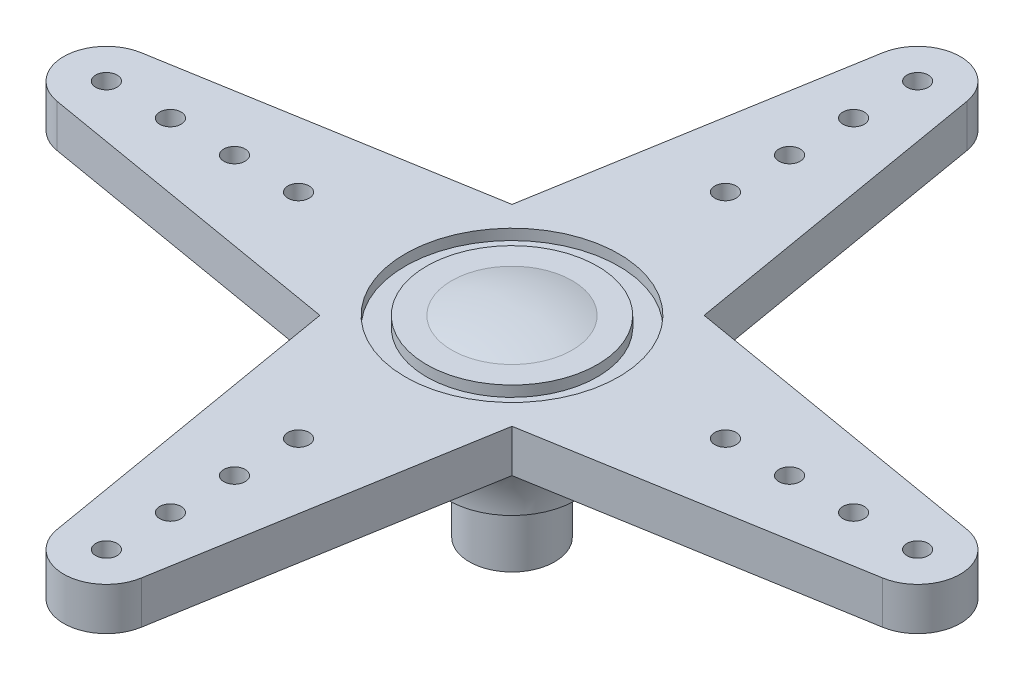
ISO-10303-21;
HEADER;
FILE_DESCRIPTION(('STEP AP214'),'2;1');
FILE_NAME('part.step','',(''),(''),'','','');
FILE_SCHEMA(('AUTOMOTIVE_DESIGN { 1 0 10303 214 1 1 1 1 }'));
ENDSEC;
DATA;
#1=APPLICATION_CONTEXT('core data for automotive mechanical design processes');
#2=APPLICATION_PROTOCOL_DEFINITION('international standard','automotive_design',2000,#1);
#3=PRODUCT_CONTEXT('',#1,'mechanical');
#4=PRODUCT('Part','Part','',(#3));
#5=PRODUCT_RELATED_PRODUCT_CATEGORY('part','',(#4));
#6=PRODUCT_DEFINITION_FORMATION('','',#4);
#7=PRODUCT_DEFINITION_CONTEXT('part definition',#1,'design');
#8=PRODUCT_DEFINITION('design','',#6,#7);
#9=PRODUCT_DEFINITION_SHAPE('','',#8);
#10=(LENGTH_UNIT() NAMED_UNIT(*) SI_UNIT(.MILLI.,.METRE.));
#11=(NAMED_UNIT(*) PLANE_ANGLE_UNIT() SI_UNIT($,.RADIAN.));
#12=(NAMED_UNIT(*) SI_UNIT($,.STERADIAN.) SOLID_ANGLE_UNIT());
#13=UNCERTAINTY_MEASURE_WITH_UNIT(LENGTH_MEASURE(1.E-05),#10,'distance_accuracy_value','');
#14=(GEOMETRIC_REPRESENTATION_CONTEXT(3) GLOBAL_UNCERTAINTY_ASSIGNED_CONTEXT((#13)) GLOBAL_UNIT_ASSIGNED_CONTEXT((#10,
#11,#12)) REPRESENTATION_CONTEXT('',''));
#15=CARTESIAN_POINT('',(0.,0.,0.));
#16=DIRECTION('',(0.,0.,1.));
#17=DIRECTION('',(1.,0.,0.));
#18=AXIS2_PLACEMENT_3D('',#15,#16,#17);
#19=CARTESIAN_POINT('',(19.,9.,0.));
#20=DIRECTION('',(0.,-1.,0.));
#21=DIRECTION('',(0.,0.,-1.));
#22=AXIS2_PLACEMENT_3D('',#19,#20,#21);
#23=PLANE('',#22);
#24=CARTESIAN_POINT('',(0.,9.,0.));
#25=DIRECTION('',(0.,1.,0.));
#26=DIRECTION('',(0.,0.,1.));
#27=AXIS2_PLACEMENT_3D('',#24,#25,#26);
#28=CIRCLE('',#27,4.);
#29=CARTESIAN_POINT('',(0.,9.,4.));
#30=VERTEX_POINT('',#29);
#31=EDGE_CURVE('E733',#30,#30,#28,.T.);
#32=ORIENTED_EDGE('',*,*,#31,.T.);
#33=EDGE_LOOP('',(#32));
#34=FACE_BOUND('',#33,.T.);
#35=CARTESIAN_POINT('',(0.,9.,0.));
#36=DIRECTION('',(0.,-1.,0.));
#37=DIRECTION('',(0.,0.,-1.));
#38=AXIS2_PLACEMENT_3D('',#35,#36,#37);
#39=CIRCLE('',#38,2.8216828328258);
#40=CARTESIAN_POINT('',(0.,9.,-2.8216828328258));
#41=VERTEX_POINT('',#40);
#42=EDGE_CURVE('E11',#41,#41,#39,.F.);
#43=ORIENTED_EDGE('',*,*,#42,.F.);
#44=EDGE_LOOP('',(#43));
#45=FACE_BOUND('',#44,.T.);
#46=ADVANCED_FACE('F31',(#34,#45),#23,.F.);
#47=CARTESIAN_POINT('',(0.,0.,0.));
#48=DIRECTION('',(0.,-1.,0.));
#49=DIRECTION('',(0.,0.,-1.));
#50=AXIS2_PLACEMENT_3D('',#47,#48,#49);
#51=CYLINDRICAL_SURFACE('',#50,4.);
#52=CARTESIAN_POINT('',(0.,6.,0.));
#53=DIRECTION('',(0.,-1.,0.));
#54=DIRECTION('',(0.,0.,-1.));
#55=AXIS2_PLACEMENT_3D('',#52,#53,#54);
#56=CIRCLE('',#55,4.);
#57=CARTESIAN_POINT('',(0.,6.,-4.));
#58=VERTEX_POINT('',#57);
#59=EDGE_CURVE('E164',#58,#58,#56,.T.);
#60=ORIENTED_EDGE('',*,*,#59,.F.);
#61=EDGE_LOOP('',(#60));
#62=FACE_BOUND('',#61,.T.);
#63=CARTESIAN_POINT('',(0.,7.,0.));
#64=DIRECTION('',(0.,-1.,0.));
#65=DIRECTION('',(0.,0.,-1.));
#66=AXIS2_PLACEMENT_3D('',#63,#64,#65);
#67=CIRCLE('',#66,4.);
#68=CARTESIAN_POINT('',(0.,7.,-4.));
#69=VERTEX_POINT('',#68);
#70=EDGE_CURVE('E39',#69,#69,#67,.T.);
#71=ORIENTED_EDGE('',*,*,#70,.T.);
#72=EDGE_LOOP('',(#71));
#73=FACE_BOUND('',#72,.T.);
#74=ADVANCED_FACE('F33',(#62,#73),#51,.T.);
#75=CARTESIAN_POINT('',(0.,3.,0.));
#76=DIRECTION('',(0.,-1.,0.));
#77=DIRECTION('',(0.,0.,-1.));
#78=AXIS2_PLACEMENT_3D('',#75,#76,#77);
#79=TOROIDAL_SURFACE('',#78,8.,5.);
#80=CARTESIAN_POINT('',(0.,3.,0.));
#81=DIRECTION('',(0.,-1.,0.));
#82=DIRECTION('',(0.,0.,-1.));
#83=AXIS2_PLACEMENT_3D('',#80,#81,#82);
#84=CIRCLE('',#83,3.);
#85=CARTESIAN_POINT('',(0.,3.,-3.));
#86=VERTEX_POINT('',#85);
#87=EDGE_CURVE('E161',#86,#86,#84,.T.);
#88=ORIENTED_EDGE('',*,*,#87,.F.);
#89=EDGE_LOOP('',(#88));
#90=FACE_BOUND('',#89,.T.);
#91=ORIENTED_EDGE('',*,*,#59,.T.);
#92=EDGE_LOOP('',(#91));
#93=FACE_BOUND('',#92,.T.);
#94=ADVANCED_FACE('F436',(#90,#93),#79,.F.);
#95=CARTESIAN_POINT('',(-2.,3.,0.));
#96=DIRECTION('',(0.,1.,0.));
#97=DIRECTION('',(0.,0.,1.));
#98=AXIS2_PLACEMENT_3D('',#95,#96,#97);
#99=PLANE('',#98);
#100=CARTESIAN_POINT('',(0.,3.,0.));
#101=DIRECTION('',(0.,-1.,0.));
#102=DIRECTION('',(0.,0.,-1.));
#103=AXIS2_PLACEMENT_3D('',#100,#101,#102);
#104=CIRCLE('',#103,2.);
#105=CARTESIAN_POINT('',(0.,3.,-2.));
#106=VERTEX_POINT('',#105);
#107=EDGE_CURVE('E158',#106,#106,#104,.T.);
#108=ORIENTED_EDGE('',*,*,#107,.F.);
#109=EDGE_LOOP('',(#108));
#110=FACE_BOUND('',#109,.T.);
#111=ORIENTED_EDGE('',*,*,#87,.T.);
#112=EDGE_LOOP('',(#111));
#113=FACE_BOUND('',#112,.T.);
#114=ADVANCED_FACE('F455',(#110,#113),#99,.F.);
#115=CARTESIAN_POINT('',(0.,0.,0.));
#116=DIRECTION('',(0.,-1.,0.));
#117=DIRECTION('',(0.,0.,-1.));
#118=AXIS2_PLACEMENT_3D('',#115,#116,#117);
#119=CYLINDRICAL_SURFACE('',#118,2.);
#120=CARTESIAN_POINT('',(0.,0.,0.));
#121=DIRECTION('',(0.,-1.,0.));
#122=DIRECTION('',(0.,0.,-1.));
#123=AXIS2_PLACEMENT_3D('',#120,#121,#122);
#124=CIRCLE('',#123,2.);
#125=CARTESIAN_POINT('',(0.,0.,-2.));
#126=VERTEX_POINT('',#125);
#127=EDGE_CURVE('E155',#126,#126,#124,.T.);
#128=ORIENTED_EDGE('',*,*,#127,.F.);
#129=EDGE_LOOP('',(#128));
#130=FACE_BOUND('',#129,.T.);
#131=ORIENTED_EDGE('',*,*,#107,.T.);
#132=EDGE_LOOP('',(#131));
#133=FACE_BOUND('',#132,.T.);
#134=ADVANCED_FACE('F451',(#130,#133),#119,.T.);
#135=CARTESIAN_POINT('',(0.,0.,0.));
#136=DIRECTION('',(0.,1.,0.));
#137=DIRECTION('',(0.,0.,1.));
#138=AXIS2_PLACEMENT_3D('',#135,#136,#137);
#139=PLANE('',#138);
#140=ORIENTED_EDGE('',*,*,#127,.T.);
#141=EDGE_LOOP('',(#140));
#142=FACE_BOUND('',#141,.T.);
#143=ADVANCED_FACE('F173',(#142),#139,.F.);
#144=CARTESIAN_POINT('',(19.,7.,0.));
#145=DIRECTION('',(0.,-1.,0.));
#146=DIRECTION('',(0.,0.,-1.));
#147=AXIS2_PLACEMENT_3D('',#144,#145,#146);
#148=PLANE('',#147);
#149=DIRECTION('',(0.985786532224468,0.,-0.16800271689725));
#150=VECTOR('',#149,1.);
#151=CARTESIAN_POINT('',(4.49999999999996,7.,4.50000000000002));
#152=LINE('',#151,#150);
#153=CARTESIAN_POINT('',(4.49999999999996,7.,4.50000000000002));
#154=VERTEX_POINT('',#153);
#155=CARTESIAN_POINT('',(19.3360054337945,7.,1.97157306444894));
#156=VERTEX_POINT('',#155);
#157=EDGE_CURVE('E287',#154,#156,#152,.T.);
#158=ORIENTED_EDGE('',*,*,#157,.F.);
#159=DIRECTION('',(0.168002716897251,0.,-0.985786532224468));
#160=VECTOR('',#159,1.);
#161=CARTESIAN_POINT('',(4.49999999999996,7.,4.50000000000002));
#162=LINE('',#161,#160);
#163=CARTESIAN_POINT('',(1.97157306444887,7.,19.3360054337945));
#164=VERTEX_POINT('',#163);
#165=EDGE_CURVE('E244',#164,#154,#162,.T.);
#166=ORIENTED_EDGE('',*,*,#165,.F.);
#167=CARTESIAN_POINT('',(0.,7.,19.));
#168=DIRECTION('',(0.,1.,0.));
#169=DIRECTION('',(1.,0.,0.));
#170=AXIS2_PLACEMENT_3D('',#167,#168,#169);
#171=CIRCLE('',#170,2.);
#172=CARTESIAN_POINT('',(-1.97157306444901,7.,19.3360054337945));
#173=VERTEX_POINT('',#172);
#174=EDGE_CURVE('E242',#173,#164,#171,.T.);
#175=ORIENTED_EDGE('',*,*,#174,.F.);
#176=DIRECTION('',(0.168002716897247,0.,0.985786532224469));
#177=VECTOR('',#176,1.);
#178=CARTESIAN_POINT('',(-4.50000000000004,7.,4.49999999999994));
#179=LINE('',#178,#177);
#180=CARTESIAN_POINT('',(-4.50000000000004,7.,4.49999999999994));
#181=VERTEX_POINT('',#180);
#182=EDGE_CURVE('E240',#181,#173,#179,.T.);
#183=ORIENTED_EDGE('',*,*,#182,.F.);
#184=DIRECTION('',(0.985786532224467,0.,0.168002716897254));
#185=VECTOR('',#184,1.);
#186=CARTESIAN_POINT('',(-4.50000000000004,7.,4.49999999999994));
#187=LINE('',#186,#185);
#188=CARTESIAN_POINT('',(-19.3360054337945,7.,1.9715730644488));
#189=VERTEX_POINT('',#188);
#190=EDGE_CURVE('E310',#189,#181,#187,.T.);
#191=ORIENTED_EDGE('',*,*,#190,.F.);
#192=CARTESIAN_POINT('',(-19.,7.,-1.32676367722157E-13));
#193=DIRECTION('',(0.,1.,0.));
#194=DIRECTION('',(0.,0.,1.));
#195=AXIS2_PLACEMENT_3D('',#192,#193,#194);
#196=CIRCLE('',#195,2.);
#197=CARTESIAN_POINT('',(-19.3360054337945,7.,-1.97157306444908));
#198=VERTEX_POINT('',#197);
#199=EDGE_CURVE('E322',#198,#189,#196,.T.);
#200=ORIENTED_EDGE('',*,*,#199,.F.);
#201=DIRECTION('',(-0.985786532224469,0.,0.168002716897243));
#202=VECTOR('',#201,1.);
#203=CARTESIAN_POINT('',(-4.49999999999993,7.,-4.50000000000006));
#204=LINE('',#203,#202);
#205=CARTESIAN_POINT('',(-4.49999999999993,7.,-4.50000000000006));
#206=VERTEX_POINT('',#205);
#207=EDGE_CURVE('E326',#206,#198,#204,.T.);
#208=ORIENTED_EDGE('',*,*,#207,.F.);
#209=DIRECTION('',(-0.168002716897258,0.,0.985786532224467));
#210=VECTOR('',#209,1.);
#211=CARTESIAN_POINT('',(-4.49999999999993,7.,-4.50000000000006));
#212=LINE('',#211,#210);
#213=CARTESIAN_POINT('',(-1.97157306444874,7.,-19.3360054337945));
#214=VERTEX_POINT('',#213);
#215=EDGE_CURVE('E348',#214,#206,#212,.T.);
#216=ORIENTED_EDGE('',*,*,#215,.F.);
#217=CARTESIAN_POINT('',(1.99014551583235E-13,7.,-19.));
#218=DIRECTION('',(0.,1.,0.));
#219=DIRECTION('',(-1.,0.,0.));
#220=AXIS2_PLACEMENT_3D('',#217,#218,#219);
#221=CIRCLE('',#220,2.);
#222=CARTESIAN_POINT('',(1.97157306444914,7.,-19.3360054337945));
#223=VERTEX_POINT('',#222);
#224=EDGE_CURVE('E136',#223,#214,#221,.T.);
#225=ORIENTED_EDGE('',*,*,#224,.F.);
#226=DIRECTION('',(-0.16800271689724,0.,-0.98578653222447));
#227=VECTOR('',#226,1.);
#228=CARTESIAN_POINT('',(4.50000000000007,7.,-4.49999999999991));
#229=LINE('',#228,#227);
#230=CARTESIAN_POINT('',(4.50000000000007,7.,-4.49999999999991));
#231=VERTEX_POINT('',#230);
#232=EDGE_CURVE('E132',#231,#223,#229,.T.);
#233=ORIENTED_EDGE('',*,*,#232,.F.);
#234=DIRECTION('',(-0.985786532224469,0.,-0.168002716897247));
#235=VECTOR('',#234,1.);
#236=CARTESIAN_POINT('',(4.50000000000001,7.,-4.49999999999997));
#237=LINE('',#236,#235);
#238=CARTESIAN_POINT('',(19.3360054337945,7.,-1.97157306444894));
#239=VERTEX_POINT('',#238);
#240=EDGE_CURVE('E119',#239,#231,#237,.T.);
#241=ORIENTED_EDGE('',*,*,#240,.F.);
#242=CARTESIAN_POINT('',(19.,7.,0.));
#243=DIRECTION('',(0.,1.,0.));
#244=DIRECTION('',(0.,0.,-1.));
#245=AXIS2_PLACEMENT_3D('',#242,#243,#244);
#246=CIRCLE('',#245,2.);
#247=EDGE_CURVE('E129',#156,#239,#246,.T.);
#248=ORIENTED_EDGE('',*,*,#247,.F.);
#249=EDGE_LOOP('',(#158,#166,#175,#183,#191,#200,#208,#216,#225,#233,#241,#248));
#250=FACE_BOUND('',#249,.T.);
#251=CARTESIAN_POINT('',(10.,7.,0.));
#252=DIRECTION('',(0.,1.,0.));
#253=DIRECTION('',(0.,0.,1.));
#254=AXIS2_PLACEMENT_3D('',#251,#252,#253);
#255=CIRCLE('',#254,0.499999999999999);
#256=CARTESIAN_POINT('',(10.,7.,0.499999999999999));
#257=VERTEX_POINT('',#256);
#258=EDGE_CURVE('E263',#257,#257,#255,.T.);
#259=ORIENTED_EDGE('',*,*,#258,.T.);
#260=EDGE_LOOP('',(#259));
#261=FACE_BOUND('',#260,.T.);
#262=CARTESIAN_POINT('',(16.,7.,0.));
#263=DIRECTION('',(0.,1.,0.));
#264=DIRECTION('',(0.,0.,1.));
#265=AXIS2_PLACEMENT_3D('',#262,#263,#264);
#266=CIRCLE('',#265,0.499999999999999);
#267=CARTESIAN_POINT('',(16.,7.,0.499999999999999));
#268=VERTEX_POINT('',#267);
#269=EDGE_CURVE('E275',#268,#268,#266,.T.);
#270=ORIENTED_EDGE('',*,*,#269,.T.);
#271=EDGE_LOOP('',(#270));
#272=FACE_BOUND('',#271,.T.);
#273=CARTESIAN_POINT('',(19.,7.,0.));
#274=DIRECTION('',(0.,1.,0.));
#275=DIRECTION('',(0.,0.,1.));
#276=AXIS2_PLACEMENT_3D('',#273,#274,#275);
#277=CIRCLE('',#276,0.499999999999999);
#278=CARTESIAN_POINT('',(19.,7.,0.499999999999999));
#279=VERTEX_POINT('',#278);
#280=EDGE_CURVE('E281',#279,#279,#277,.T.);
#281=ORIENTED_EDGE('',*,*,#280,.T.);
#282=EDGE_LOOP('',(#281));
#283=FACE_BOUND('',#282,.T.);
#284=CARTESIAN_POINT('',(13.,7.,0.));
#285=DIRECTION('',(0.,1.,0.));
#286=DIRECTION('',(0.,0.,1.));
#287=AXIS2_PLACEMENT_3D('',#284,#285,#286);
#288=CIRCLE('',#287,0.499999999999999);
#289=CARTESIAN_POINT('',(13.,7.,0.499999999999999));
#290=VERTEX_POINT('',#289);
#291=EDGE_CURVE('E269',#290,#290,#288,.T.);
#292=ORIENTED_EDGE('',*,*,#291,.T.);
#293=EDGE_LOOP('',(#292));
#294=FACE_BOUND('',#293,.T.);
#295=ORIENTED_EDGE('',*,*,#70,.F.);
#296=EDGE_LOOP('',(#295));
#297=FACE_BOUND('',#296,.T.);
#298=CARTESIAN_POINT('',(1.04744500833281E-13,7.,-10.));
#299=DIRECTION('',(0.,1.,0.));
#300=DIRECTION('',(1.,0.,0.));
#301=AXIS2_PLACEMENT_3D('',#298,#299,#300);
#302=CIRCLE('',#301,0.499999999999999);
#303=CARTESIAN_POINT('',(0.500000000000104,7.,-9.99999999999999));
#304=VERTEX_POINT('',#303);
#305=EDGE_CURVE('E178',#304,#304,#302,.T.);
#306=ORIENTED_EDGE('',*,*,#305,.T.);
#307=EDGE_LOOP('',(#306));
#308=FACE_BOUND('',#307,.T.);
#309=CARTESIAN_POINT('',(1.6759120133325E-13,7.,-16.));
#310=DIRECTION('',(0.,1.,0.));
#311=DIRECTION('',(1.,0.,0.));
#312=AXIS2_PLACEMENT_3D('',#309,#310,#311);
#313=CIRCLE('',#312,0.499999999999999);
#314=CARTESIAN_POINT('',(0.500000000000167,7.,-16.));
#315=VERTEX_POINT('',#314);
#316=EDGE_CURVE('E182',#315,#315,#313,.T.);
#317=ORIENTED_EDGE('',*,*,#316,.T.);
#318=EDGE_LOOP('',(#317));
#319=FACE_BOUND('',#318,.T.);
#320=CARTESIAN_POINT('',(1.99014551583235E-13,7.,-19.));
#321=DIRECTION('',(0.,1.,0.));
#322=DIRECTION('',(1.,0.,0.));
#323=AXIS2_PLACEMENT_3D('',#320,#321,#322);
#324=CIRCLE('',#323,0.499999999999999);
#325=CARTESIAN_POINT('',(0.500000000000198,7.,-19.));
#326=VERTEX_POINT('',#325);
#327=EDGE_CURVE('E186',#326,#326,#324,.T.);
#328=ORIENTED_EDGE('',*,*,#327,.T.);
#329=EDGE_LOOP('',(#328));
#330=FACE_BOUND('',#329,.T.);
#331=CARTESIAN_POINT('',(1.36167851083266E-13,7.,-13.));
#332=DIRECTION('',(0.,1.,0.));
#333=DIRECTION('',(1.,0.,0.));
#334=AXIS2_PLACEMENT_3D('',#331,#332,#333);
#335=CIRCLE('',#334,0.499999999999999);
#336=CARTESIAN_POINT('',(0.500000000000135,7.,-13.));
#337=VERTEX_POINT('',#336);
#338=EDGE_CURVE('E190',#337,#337,#335,.T.);
#339=ORIENTED_EDGE('',*,*,#338,.T.);
#340=EDGE_LOOP('',(#339));
#341=FACE_BOUND('',#340,.T.);
#342=CARTESIAN_POINT('',(-10.,7.,0.));
#343=DIRECTION('',(0.,1.,0.));
#344=DIRECTION('',(0.,0.,-1.));
#345=AXIS2_PLACEMENT_3D('',#342,#343,#344);
#346=CIRCLE('',#345,0.499999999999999);
#347=CARTESIAN_POINT('',(-9.99999999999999,7.,-0.500000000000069));
#348=VERTEX_POINT('',#347);
#349=EDGE_CURVE('E194',#348,#348,#346,.T.);
#350=ORIENTED_EDGE('',*,*,#349,.T.);
#351=EDGE_LOOP('',(#350));
#352=FACE_BOUND('',#351,.T.);
#353=CARTESIAN_POINT('',(-16.,7.,-1.117274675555E-13));
#354=DIRECTION('',(0.,1.,0.));
#355=DIRECTION('',(0.,0.,-1.));
#356=AXIS2_PLACEMENT_3D('',#353,#354,#355);
#357=CIRCLE('',#356,0.499999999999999);
#358=CARTESIAN_POINT('',(-16.,7.,-0.500000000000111));
#359=VERTEX_POINT('',#358);
#360=EDGE_CURVE('E198',#359,#359,#357,.T.);
#361=ORIENTED_EDGE('',*,*,#360,.T.);
#362=EDGE_LOOP('',(#361));
#363=FACE_BOUND('',#362,.T.);
#364=CARTESIAN_POINT('',(-19.,7.,-1.32676367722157E-13));
#365=DIRECTION('',(0.,1.,0.));
#366=DIRECTION('',(0.,0.,-1.));
#367=AXIS2_PLACEMENT_3D('',#364,#365,#366);
#368=CIRCLE('',#367,0.499999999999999);
#369=CARTESIAN_POINT('',(-19.,7.,-0.500000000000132));
#370=VERTEX_POINT('',#369);
#371=EDGE_CURVE('E202',#370,#370,#368,.T.);
#372=ORIENTED_EDGE('',*,*,#371,.T.);
#373=EDGE_LOOP('',(#372));
#374=FACE_BOUND('',#373,.T.);
#375=CARTESIAN_POINT('',(-13.,7.,0.));
#376=DIRECTION('',(0.,1.,0.));
#377=DIRECTION('',(0.,0.,-1.));
#378=AXIS2_PLACEMENT_3D('',#375,#376,#377);
#379=CIRCLE('',#378,0.499999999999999);
#380=CARTESIAN_POINT('',(-13.,7.,-0.50000000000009));
#381=VERTEX_POINT('',#380);
#382=EDGE_CURVE('E206',#381,#381,#379,.T.);
#383=ORIENTED_EDGE('',*,*,#382,.T.);
#384=EDGE_LOOP('',(#383));
#385=FACE_BOUND('',#384,.T.);
#386=CARTESIAN_POINT('',(0.,7.,10.));
#387=DIRECTION('',(0.,1.,0.));
#388=DIRECTION('',(-1.,0.,0.));
#389=AXIS2_PLACEMENT_3D('',#386,#387,#388);
#390=CIRCLE('',#389,0.499999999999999);
#391=CARTESIAN_POINT('',(-0.500000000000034,7.,10.));
#392=VERTEX_POINT('',#391);
#393=EDGE_CURVE('E210',#392,#392,#390,.T.);
#394=ORIENTED_EDGE('',*,*,#393,.T.);
#395=EDGE_LOOP('',(#394));
#396=FACE_BOUND('',#395,.T.);
#397=CARTESIAN_POINT('',(0.,7.,16.));
#398=DIRECTION('',(0.,1.,0.));
#399=DIRECTION('',(-1.,0.,0.));
#400=AXIS2_PLACEMENT_3D('',#397,#398,#399);
#401=CIRCLE('',#400,0.499999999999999);
#402=CARTESIAN_POINT('',(-0.500000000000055,7.,16.));
#403=VERTEX_POINT('',#402);
#404=EDGE_CURVE('E214',#403,#403,#401,.T.);
#405=ORIENTED_EDGE('',*,*,#404,.T.);
#406=EDGE_LOOP('',(#405));
#407=FACE_BOUND('',#406,.T.);
#408=CARTESIAN_POINT('',(0.,7.,19.));
#409=DIRECTION('',(0.,1.,0.));
#410=DIRECTION('',(-1.,0.,0.));
#411=AXIS2_PLACEMENT_3D('',#408,#409,#410);
#412=CIRCLE('',#411,0.499999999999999);
#413=CARTESIAN_POINT('',(-0.500000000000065,7.,19.));
#414=VERTEX_POINT('',#413);
#415=EDGE_CURVE('E218',#414,#414,#412,.T.);
#416=ORIENTED_EDGE('',*,*,#415,.T.);
#417=EDGE_LOOP('',(#416));
#418=FACE_BOUND('',#417,.T.);
#419=CARTESIAN_POINT('',(0.,7.,13.));
#420=DIRECTION('',(0.,1.,0.));
#421=DIRECTION('',(-1.,0.,0.));
#422=AXIS2_PLACEMENT_3D('',#419,#420,#421);
#423=CIRCLE('',#422,0.499999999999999);
#424=CARTESIAN_POINT('',(-0.500000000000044,7.,13.));
#425=VERTEX_POINT('',#424);
#426=EDGE_CURVE('E221',#425,#425,#423,.T.);
#427=ORIENTED_EDGE('',*,*,#426,.T.);
#428=EDGE_LOOP('',(#427));
#429=FACE_BOUND('',#428,.T.);
#430=ADVANCED_FACE('F133',(#250,#261,#272,#283,#294,#297,#308,#319,#330,#341,#352,#363,#374,
#385,#396,#407,#418,#429),#148,.T.);
#431=CARTESIAN_POINT('',(0.,9.,0.));
#432=DIRECTION('',(0.,1.,0.));
#433=DIRECTION('',(0.,0.,1.));
#434=AXIS2_PLACEMENT_3D('',#431,#432,#433);
#435=CIRCLE('',#434,5.);
#436=CARTESIAN_POINT('',(0.,9.,5.));
#437=VERTEX_POINT('',#436);
#438=EDGE_CURVE('E735',#437,#437,#435,.T.);
#439=ORIENTED_EDGE('',*,*,#438,.F.);
#440=EDGE_LOOP('',(#439));
#441=FACE_BOUND('',#440,.T.);
#442=DIRECTION('',(0.168002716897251,0.,-0.985786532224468));
#443=VECTOR('',#442,1.);
#444=CARTESIAN_POINT('',(4.49999999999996,9.,4.50000000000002));
#445=LINE('',#444,#443);
#446=CARTESIAN_POINT('',(1.97157306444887,9.,19.3360054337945));
#447=VERTEX_POINT('',#446);
#448=CARTESIAN_POINT('',(4.49999999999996,9.,4.50000000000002));
#449=VERTEX_POINT('',#448);
#450=EDGE_CURVE('E251',#447,#449,#445,.T.);
#451=ORIENTED_EDGE('',*,*,#450,.T.);
#452=DIRECTION('',(0.985786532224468,0.,-0.16800271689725));
#453=VECTOR('',#452,1.);
#454=CARTESIAN_POINT('',(4.49999999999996,9.,4.50000000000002));
#455=LINE('',#454,#453);
#456=CARTESIAN_POINT('',(19.3360054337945,9.,1.97157306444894));
#457=VERTEX_POINT('',#456);
#458=EDGE_CURVE('E128',#449,#457,#455,.T.);
#459=ORIENTED_EDGE('',*,*,#458,.T.);
#460=CARTESIAN_POINT('',(19.,9.,0.));
#461=DIRECTION('',(0.,1.,0.));
#462=DIRECTION('',(0.,0.,-1.));
#463=AXIS2_PLACEMENT_3D('',#460,#461,#462);
#464=CIRCLE('',#463,2.);
#465=CARTESIAN_POINT('',(19.3360054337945,9.,-1.97157306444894));
#466=VERTEX_POINT('',#465);
#467=EDGE_CURVE('E51',#457,#466,#464,.T.);
#468=ORIENTED_EDGE('',*,*,#467,.T.);
#469=DIRECTION('',(-0.985786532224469,0.,-0.168002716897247));
#470=VECTOR('',#469,1.);
#471=CARTESIAN_POINT('',(4.50000000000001,9.,-4.49999999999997));
#472=LINE('',#471,#470);
#473=CARTESIAN_POINT('',(4.50000000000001,9.,-4.49999999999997));
#474=VERTEX_POINT('',#473);
#475=EDGE_CURVE('E46',#466,#474,#472,.T.);
#476=ORIENTED_EDGE('',*,*,#475,.T.);
#477=DIRECTION('',(-0.16800271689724,0.,-0.98578653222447));
#478=VECTOR('',#477,1.);
#479=CARTESIAN_POINT('',(4.50000000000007,9.,-4.49999999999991));
#480=LINE('',#479,#478);
#481=CARTESIAN_POINT('',(1.97157306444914,9.,-19.3360054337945));
#482=VERTEX_POINT('',#481);
#483=EDGE_CURVE('E143',#474,#482,#480,.T.);
#484=ORIENTED_EDGE('',*,*,#483,.T.);
#485=CARTESIAN_POINT('',(1.99014551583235E-13,9.,-19.));
#486=DIRECTION('',(0.,1.,0.));
#487=DIRECTION('',(-1.,0.,0.));
#488=AXIS2_PLACEMENT_3D('',#485,#486,#487);
#489=CIRCLE('',#488,2.);
#490=CARTESIAN_POINT('',(-1.97157306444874,9.,-19.3360054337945));
#491=VERTEX_POINT('',#490);
#492=EDGE_CURVE('E353',#482,#491,#489,.T.);
#493=ORIENTED_EDGE('',*,*,#492,.T.);
#494=DIRECTION('',(-0.168002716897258,0.,0.985786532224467));
#495=VECTOR('',#494,1.);
#496=CARTESIAN_POINT('',(-4.49999999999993,9.,-4.50000000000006));
#497=LINE('',#496,#495);
#498=CARTESIAN_POINT('',(-4.49999999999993,9.,-4.50000000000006));
#499=VERTEX_POINT('',#498);
#500=EDGE_CURVE('E358',#491,#499,#497,.T.);
#501=ORIENTED_EDGE('',*,*,#500,.T.);
#502=DIRECTION('',(-0.985786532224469,0.,0.168002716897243));
#503=VECTOR('',#502,1.);
#504=CARTESIAN_POINT('',(-4.49999999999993,9.,-4.50000000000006));
#505=LINE('',#504,#503);
#506=CARTESIAN_POINT('',(-19.3360054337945,9.,-1.97157306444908));
#507=VERTEX_POINT('',#506);
#508=EDGE_CURVE('E321',#499,#507,#505,.T.);
#509=ORIENTED_EDGE('',*,*,#508,.T.);
#510=CARTESIAN_POINT('',(-19.,9.,-1.32676367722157E-13));
#511=DIRECTION('',(0.,1.,0.));
#512=DIRECTION('',(0.,0.,1.));
#513=AXIS2_PLACEMENT_3D('',#510,#511,#512);
#514=CIRCLE('',#513,2.);
#515=CARTESIAN_POINT('',(-19.3360054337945,9.,1.9715730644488));
#516=VERTEX_POINT('',#515);
#517=EDGE_CURVE('E324',#507,#516,#514,.T.);
#518=ORIENTED_EDGE('',*,*,#517,.T.);
#519=DIRECTION('',(0.985786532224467,0.,0.168002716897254));
#520=VECTOR('',#519,1.);
#521=CARTESIAN_POINT('',(-4.50000000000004,9.,4.49999999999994));
#522=LINE('',#521,#520);
#523=CARTESIAN_POINT('',(-4.50000000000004,9.,4.49999999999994));
#524=VERTEX_POINT('',#523);
#525=EDGE_CURVE('E331',#516,#524,#522,.T.);
#526=ORIENTED_EDGE('',*,*,#525,.T.);
#527=DIRECTION('',(0.168002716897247,0.,0.985786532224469));
#528=VECTOR('',#527,1.);
#529=CARTESIAN_POINT('',(-4.50000000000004,9.,4.49999999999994));
#530=LINE('',#529,#528);
#531=CARTESIAN_POINT('',(-1.97157306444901,9.,19.3360054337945));
#532=VERTEX_POINT('',#531);
#533=EDGE_CURVE('E247',#524,#532,#530,.T.);
#534=ORIENTED_EDGE('',*,*,#533,.T.);
#535=CARTESIAN_POINT('',(0.,9.,19.));
#536=DIRECTION('',(0.,1.,0.));
#537=DIRECTION('',(1.,0.,0.));
#538=AXIS2_PLACEMENT_3D('',#535,#536,#537);
#539=CIRCLE('',#538,2.);
#540=EDGE_CURVE('E249',#532,#447,#539,.T.);
#541=ORIENTED_EDGE('',*,*,#540,.T.);
#542=EDGE_LOOP('',(#451,#459,#468,#476,#484,#493,#501,#509,#518,#526,#534,#541));
#543=FACE_BOUND('',#542,.T.);
#544=CARTESIAN_POINT('',(13.,9.,0.));
#545=DIRECTION('',(0.,1.,0.));
#546=DIRECTION('',(0.,0.,1.));
#547=AXIS2_PLACEMENT_3D('',#544,#545,#546);
#548=CIRCLE('',#547,0.499999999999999);
#549=CARTESIAN_POINT('',(13.,9.,0.499999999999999));
#550=VERTEX_POINT('',#549);
#551=EDGE_CURVE('E272',#550,#550,#548,.T.);
#552=ORIENTED_EDGE('',*,*,#551,.F.);
#553=EDGE_LOOP('',(#552));
#554=FACE_BOUND('',#553,.T.);
#555=CARTESIAN_POINT('',(19.,9.,0.));
#556=DIRECTION('',(0.,1.,0.));
#557=DIRECTION('',(0.,0.,1.));
#558=AXIS2_PLACEMENT_3D('',#555,#556,#557);
#559=CIRCLE('',#558,0.499999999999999);
#560=CARTESIAN_POINT('',(19.,9.,0.499999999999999));
#561=VERTEX_POINT('',#560);
#562=EDGE_CURVE('E284',#561,#561,#559,.T.);
#563=ORIENTED_EDGE('',*,*,#562,.F.);
#564=EDGE_LOOP('',(#563));
#565=FACE_BOUND('',#564,.T.);
#566=CARTESIAN_POINT('',(16.,9.,0.));
#567=DIRECTION('',(0.,1.,0.));
#568=DIRECTION('',(0.,0.,1.));
#569=AXIS2_PLACEMENT_3D('',#566,#567,#568);
#570=CIRCLE('',#569,0.499999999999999);
#571=CARTESIAN_POINT('',(16.,9.,0.499999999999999));
#572=VERTEX_POINT('',#571);
#573=EDGE_CURVE('E278',#572,#572,#570,.T.);
#574=ORIENTED_EDGE('',*,*,#573,.F.);
#575=EDGE_LOOP('',(#574));
#576=FACE_BOUND('',#575,.T.);
#577=CARTESIAN_POINT('',(10.,9.,0.));
#578=DIRECTION('',(0.,1.,0.));
#579=DIRECTION('',(0.,0.,1.));
#580=AXIS2_PLACEMENT_3D('',#577,#578,#579);
#581=CIRCLE('',#580,0.499999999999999);
#582=CARTESIAN_POINT('',(10.,9.,0.499999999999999));
#583=VERTEX_POINT('',#582);
#584=EDGE_CURVE('E266',#583,#583,#581,.T.);
#585=ORIENTED_EDGE('',*,*,#584,.F.);
#586=EDGE_LOOP('',(#585));
#587=FACE_BOUND('',#586,.T.);
#588=CARTESIAN_POINT('',(0.,9.,13.));
#589=DIRECTION('',(0.,1.,0.));
#590=DIRECTION('',(-1.,0.,0.));
#591=AXIS2_PLACEMENT_3D('',#588,#589,#590);
#592=CIRCLE('',#591,0.499999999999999);
#593=CARTESIAN_POINT('',(-0.500000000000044,9.,13.));
#594=VERTEX_POINT('',#593);
#595=EDGE_CURVE('E223',#594,#594,#592,.T.);
#596=ORIENTED_EDGE('',*,*,#595,.F.);
#597=EDGE_LOOP('',(#596));
#598=FACE_BOUND('',#597,.T.);
#599=CARTESIAN_POINT('',(0.,9.,19.));
#600=DIRECTION('',(0.,1.,0.));
#601=DIRECTION('',(-1.,0.,0.));
#602=AXIS2_PLACEMENT_3D('',#599,#600,#601);
#603=CIRCLE('',#602,0.499999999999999);
#604=CARTESIAN_POINT('',(-0.500000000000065,9.,19.));
#605=VERTEX_POINT('',#604);
#606=EDGE_CURVE('E237',#605,#605,#603,.T.);
#607=ORIENTED_EDGE('',*,*,#606,.F.);
#608=EDGE_LOOP('',(#607));
#609=FACE_BOUND('',#608,.T.);
#610=CARTESIAN_POINT('',(0.,9.,16.));
#611=DIRECTION('',(0.,1.,0.));
#612=DIRECTION('',(-1.,0.,0.));
#613=AXIS2_PLACEMENT_3D('',#610,#611,#612);
#614=CIRCLE('',#613,0.499999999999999);
#615=CARTESIAN_POINT('',(-0.500000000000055,9.,16.));
#616=VERTEX_POINT('',#615);
#617=EDGE_CURVE('E233',#616,#616,#614,.T.);
#618=ORIENTED_EDGE('',*,*,#617,.F.);
#619=EDGE_LOOP('',(#618));
#620=FACE_BOUND('',#619,.T.);
#621=CARTESIAN_POINT('',(0.,9.,10.));
#622=DIRECTION('',(0.,1.,0.));
#623=DIRECTION('',(-1.,0.,0.));
#624=AXIS2_PLACEMENT_3D('',#621,#622,#623);
#625=CIRCLE('',#624,0.499999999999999);
#626=CARTESIAN_POINT('',(-0.500000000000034,9.,10.));
#627=VERTEX_POINT('',#626);
#628=EDGE_CURVE('E224',#627,#627,#625,.T.);
#629=ORIENTED_EDGE('',*,*,#628,.F.);
#630=EDGE_LOOP('',(#629));
#631=FACE_BOUND('',#630,.T.);
#632=CARTESIAN_POINT('',(-13.,9.,0.));
#633=DIRECTION('',(0.,1.,0.));
#634=DIRECTION('',(0.,0.,-1.));
#635=AXIS2_PLACEMENT_3D('',#632,#633,#634);
#636=CIRCLE('',#635,0.499999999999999);
#637=CARTESIAN_POINT('',(-13.,9.,-0.50000000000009));
#638=VERTEX_POINT('',#637);
#639=EDGE_CURVE('E368',#638,#638,#636,.T.);
#640=ORIENTED_EDGE('',*,*,#639,.F.);
#641=EDGE_LOOP('',(#640));
#642=FACE_BOUND('',#641,.T.);
#643=CARTESIAN_POINT('',(-19.,9.,-1.32676367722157E-13));
#644=DIRECTION('',(0.,1.,0.));
#645=DIRECTION('',(0.,0.,-1.));
#646=AXIS2_PLACEMENT_3D('',#643,#644,#645);
#647=CIRCLE('',#646,0.499999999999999);
#648=CARTESIAN_POINT('',(-19.,9.,-0.500000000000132));
#649=VERTEX_POINT('',#648);
#650=EDGE_CURVE('E376',#649,#649,#647,.T.);
#651=ORIENTED_EDGE('',*,*,#650,.F.);
#652=EDGE_LOOP('',(#651));
#653=FACE_BOUND('',#652,.T.);
#654=CARTESIAN_POINT('',(-16.,9.,-1.117274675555E-13));
#655=DIRECTION('',(0.,1.,0.));
#656=DIRECTION('',(0.,0.,-1.));
#657=AXIS2_PLACEMENT_3D('',#654,#655,#656);
#658=CIRCLE('',#657,0.499999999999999);
#659=CARTESIAN_POINT('',(-16.,9.,-0.500000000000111));
#660=VERTEX_POINT('',#659);
#661=EDGE_CURVE('E372',#660,#660,#658,.T.);
#662=ORIENTED_EDGE('',*,*,#661,.F.);
#663=EDGE_LOOP('',(#662));
#664=FACE_BOUND('',#663,.T.);
#665=CARTESIAN_POINT('',(-10.,9.,0.));
#666=DIRECTION('',(0.,1.,0.));
#667=DIRECTION('',(0.,0.,-1.));
#668=AXIS2_PLACEMENT_3D('',#665,#666,#667);
#669=CIRCLE('',#668,0.499999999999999);
#670=CARTESIAN_POINT('',(-9.99999999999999,9.,-0.500000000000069));
#671=VERTEX_POINT('',#670);
#672=EDGE_CURVE('E364',#671,#671,#669,.T.);
#673=ORIENTED_EDGE('',*,*,#672,.F.);
#674=EDGE_LOOP('',(#673));
#675=FACE_BOUND('',#674,.T.);
#676=CARTESIAN_POINT('',(1.36167851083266E-13,9.,-13.));
#677=DIRECTION('',(0.,1.,0.));
#678=DIRECTION('',(1.,0.,0.));
#679=AXIS2_PLACEMENT_3D('',#676,#677,#678);
#680=CIRCLE('',#679,0.499999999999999);
#681=CARTESIAN_POINT('',(0.500000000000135,9.,-13.));
#682=VERTEX_POINT('',#681);
#683=EDGE_CURVE('E394',#682,#682,#680,.T.);
#684=ORIENTED_EDGE('',*,*,#683,.F.);
#685=EDGE_LOOP('',(#684));
#686=FACE_BOUND('',#685,.T.);
#687=CARTESIAN_POINT('',(1.99014551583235E-13,9.,-19.));
#688=DIRECTION('',(0.,1.,0.));
#689=DIRECTION('',(1.,0.,0.));
#690=AXIS2_PLACEMENT_3D('',#687,#688,#689);
#691=CIRCLE('',#690,0.499999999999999);
#692=CARTESIAN_POINT('',(0.500000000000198,9.,-19.));
#693=VERTEX_POINT('',#692);
#694=EDGE_CURVE('E140',#693,#693,#691,.T.);
#695=ORIENTED_EDGE('',*,*,#694,.F.);
#696=EDGE_LOOP('',(#695));
#697=FACE_BOUND('',#696,.T.);
#698=CARTESIAN_POINT('',(1.6759120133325E-13,9.,-16.));
#699=DIRECTION('',(0.,1.,0.));
#700=DIRECTION('',(1.,0.,0.));
#701=AXIS2_PLACEMENT_3D('',#698,#699,#700);
#702=CIRCLE('',#701,0.499999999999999);
#703=CARTESIAN_POINT('',(0.500000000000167,9.,-16.));
#704=VERTEX_POINT('',#703);
#705=EDGE_CURVE('E401',#704,#704,#702,.T.);
#706=ORIENTED_EDGE('',*,*,#705,.F.);
#707=EDGE_LOOP('',(#706));
#708=FACE_BOUND('',#707,.T.);
#709=CARTESIAN_POINT('',(1.04744500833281E-13,9.,-10.));
#710=DIRECTION('',(0.,1.,0.));
#711=DIRECTION('',(1.,0.,0.));
#712=AXIS2_PLACEMENT_3D('',#709,#710,#711);
#713=CIRCLE('',#712,0.499999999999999);
#714=CARTESIAN_POINT('',(0.500000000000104,9.,-9.99999999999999));
#715=VERTEX_POINT('',#714);
#716=EDGE_CURVE('E404',#715,#715,#713,.T.);
#717=ORIENTED_EDGE('',*,*,#716,.F.);
#718=EDGE_LOOP('',(#717));
#719=FACE_BOUND('',#718,.T.);
#720=ADVANCED_FACE('F172',(#441,#543,#554,#565,#576,#587,#598,#609,#620,#631,#642,#653,#664,
#675,#686,#697,#708,#719),#23,.F.);
#721=CARTESIAN_POINT('',(4.49999999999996,9.,4.50000000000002));
#722=DIRECTION('',(-0.16800271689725,0.,-0.985786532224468));
#723=DIRECTION('',(-0.985786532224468,0.,0.16800271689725));
#724=AXIS2_PLACEMENT_3D('',#721,#722,#723);
#725=PLANE('',#724);
#726=ORIENTED_EDGE('',*,*,#157,.T.);
#727=DIRECTION('',(0.,-1.,0.));
#728=VECTOR('',#727,1.);
#729=CARTESIAN_POINT('',(19.3360054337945,9.,1.97157306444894));
#730=LINE('',#729,#728);
#731=EDGE_CURVE('E145',#457,#156,#730,.T.);
#732=ORIENTED_EDGE('',*,*,#731,.F.);
#733=ORIENTED_EDGE('',*,*,#458,.F.);
#734=DIRECTION('',(0.,-1.,0.));
#735=VECTOR('',#734,1.);
#736=CARTESIAN_POINT('',(4.49999999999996,9.,4.50000000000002));
#737=LINE('',#736,#735);
#738=EDGE_CURVE('E152',#449,#154,#737,.T.);
#739=ORIENTED_EDGE('',*,*,#738,.T.);
#740=EDGE_LOOP('',(#726,#732,#733,#739));
#741=FACE_BOUND('',#740,.T.);
#742=ADVANCED_FACE('F295',(#741),#725,.F.);
#743=CARTESIAN_POINT('',(19.,9.,0.));
#744=DIRECTION('',(0.,-1.,0.));
#745=DIRECTION('',(0.,0.,-1.));
#746=AXIS2_PLACEMENT_3D('',#743,#744,#745);
#747=CYLINDRICAL_SURFACE('',#746,2.);
#748=ORIENTED_EDGE('',*,*,#247,.T.);
#749=DIRECTION('',(0.,-1.,0.));
#750=VECTOR('',#749,1.);
#751=CARTESIAN_POINT('',(19.3360054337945,9.,-1.97157306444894));
#752=LINE('',#751,#750);
#753=EDGE_CURVE('E125',#466,#239,#752,.T.);
#754=ORIENTED_EDGE('',*,*,#753,.F.);
#755=ORIENTED_EDGE('',*,*,#467,.F.);
#756=ORIENTED_EDGE('',*,*,#731,.T.);
#757=EDGE_LOOP('',(#748,#754,#755,#756));
#758=FACE_BOUND('',#757,.T.);
#759=ADVANCED_FACE('F297',(#758),#747,.T.);
#760=CARTESIAN_POINT('',(4.50000000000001,9.,-4.49999999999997));
#761=DIRECTION('',(-0.168002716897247,0.,0.985786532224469));
#762=DIRECTION('',(0.985786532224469,0.,0.168002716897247));
#763=AXIS2_PLACEMENT_3D('',#760,#761,#762);
#764=PLANE('',#763);
#765=ORIENTED_EDGE('',*,*,#240,.T.);
#766=DIRECTION('',(0.,-1.,0.));
#767=VECTOR('',#766,1.);
#768=CARTESIAN_POINT('',(4.50000000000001,9.,-4.49999999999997));
#769=LINE('',#768,#767);
#770=EDGE_CURVE('E123',#474,#231,#769,.T.);
#771=ORIENTED_EDGE('',*,*,#770,.F.);
#772=ORIENTED_EDGE('',*,*,#475,.F.);
#773=ORIENTED_EDGE('',*,*,#753,.T.);
#774=EDGE_LOOP('',(#765,#771,#772,#773));
#775=FACE_BOUND('',#774,.T.);
#776=ADVANCED_FACE('F121',(#775),#764,.F.);
#777=CARTESIAN_POINT('',(19.,9.,0.));
#778=DIRECTION('',(0.,-1.,0.));
#779=DIRECTION('',(0.,0.,-1.));
#780=AXIS2_PLACEMENT_3D('',#777,#778,#779);
#781=CYLINDRICAL_SURFACE('',#780,0.499999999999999);
#782=ORIENTED_EDGE('',*,*,#562,.T.);
#783=EDGE_LOOP('',(#782));
#784=FACE_BOUND('',#783,.T.);
#785=ORIENTED_EDGE('',*,*,#280,.F.);
#786=EDGE_LOOP('',(#785));
#787=FACE_BOUND('',#786,.T.);
#788=ADVANCED_FACE('F444',(#784,#787),#781,.F.);
#789=CARTESIAN_POINT('',(16.,9.,0.));
#790=DIRECTION('',(0.,-1.,0.));
#791=DIRECTION('',(0.,0.,-1.));
#792=AXIS2_PLACEMENT_3D('',#789,#790,#791);
#793=CYLINDRICAL_SURFACE('',#792,0.499999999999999);
#794=ORIENTED_EDGE('',*,*,#573,.T.);
#795=EDGE_LOOP('',(#794));
#796=FACE_BOUND('',#795,.T.);
#797=ORIENTED_EDGE('',*,*,#269,.F.);
#798=EDGE_LOOP('',(#797));
#799=FACE_BOUND('',#798,.T.);
#800=ADVANCED_FACE('F510',(#796,#799),#793,.F.);
#801=CARTESIAN_POINT('',(13.,9.,0.));
#802=DIRECTION('',(0.,-1.,0.));
#803=DIRECTION('',(0.,0.,-1.));
#804=AXIS2_PLACEMENT_3D('',#801,#802,#803);
#805=CYLINDRICAL_SURFACE('',#804,0.499999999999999);
#806=ORIENTED_EDGE('',*,*,#551,.T.);
#807=EDGE_LOOP('',(#806));
#808=FACE_BOUND('',#807,.T.);
#809=ORIENTED_EDGE('',*,*,#291,.F.);
#810=EDGE_LOOP('',(#809));
#811=FACE_BOUND('',#810,.T.);
#812=ADVANCED_FACE('F517',(#808,#811),#805,.F.);
#813=CARTESIAN_POINT('',(10.,9.,0.));
#814=DIRECTION('',(0.,-1.,0.));
#815=DIRECTION('',(0.,0.,-1.));
#816=AXIS2_PLACEMENT_3D('',#813,#814,#815);
#817=CYLINDRICAL_SURFACE('',#816,0.499999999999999);
#818=ORIENTED_EDGE('',*,*,#584,.T.);
#819=EDGE_LOOP('',(#818));
#820=FACE_BOUND('',#819,.T.);
#821=ORIENTED_EDGE('',*,*,#258,.F.);
#822=EDGE_LOOP('',(#821));
#823=FACE_BOUND('',#822,.T.);
#824=ADVANCED_FACE('F525',(#820,#823),#817,.F.);
#825=CARTESIAN_POINT('',(-4.50000000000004,9.,4.49999999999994));
#826=DIRECTION('',(0.985786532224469,0.,-0.168002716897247));
#827=DIRECTION('',(-0.168002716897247,0.,-0.985786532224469));
#828=AXIS2_PLACEMENT_3D('',#825,#826,#827);
#829=PLANE('',#828);
#830=ORIENTED_EDGE('',*,*,#182,.T.);
#831=DIRECTION('',(0.,-1.,0.));
#832=VECTOR('',#831,1.);
#833=CARTESIAN_POINT('',(-1.97157306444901,9.,19.3360054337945));
#834=LINE('',#833,#832);
#835=EDGE_CURVE('E257',#532,#173,#834,.T.);
#836=ORIENTED_EDGE('',*,*,#835,.F.);
#837=ORIENTED_EDGE('',*,*,#533,.F.);
#838=DIRECTION('',(0.,-1.,0.));
#839=VECTOR('',#838,1.);
#840=CARTESIAN_POINT('',(-4.50000000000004,9.,4.49999999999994));
#841=LINE('',#840,#839);
#842=EDGE_CURVE('E260',#524,#181,#841,.T.);
#843=ORIENTED_EDGE('',*,*,#842,.T.);
#844=EDGE_LOOP('',(#830,#836,#837,#843));
#845=FACE_BOUND('',#844,.T.);
#846=ADVANCED_FACE('F313',(#845),#829,.F.);
#847=CARTESIAN_POINT('',(0.,9.,19.));
#848=DIRECTION('',(0.,-1.,0.));
#849=DIRECTION('',(0.,0.,-1.));
#850=AXIS2_PLACEMENT_3D('',#847,#848,#849);
#851=CYLINDRICAL_SURFACE('',#850,2.);
#852=ORIENTED_EDGE('',*,*,#174,.T.);
#853=DIRECTION('',(0.,-1.,0.));
#854=VECTOR('',#853,1.);
#855=CARTESIAN_POINT('',(1.97157306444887,9.,19.3360054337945));
#856=LINE('',#855,#854);
#857=EDGE_CURVE('E254',#447,#164,#856,.T.);
#858=ORIENTED_EDGE('',*,*,#857,.F.);
#859=ORIENTED_EDGE('',*,*,#540,.F.);
#860=ORIENTED_EDGE('',*,*,#835,.T.);
#861=EDGE_LOOP('',(#852,#858,#859,#860));
#862=FACE_BOUND('',#861,.T.);
#863=ADVANCED_FACE('F305',(#862),#851,.T.);
#864=CARTESIAN_POINT('',(4.49999999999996,9.,4.50000000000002));
#865=DIRECTION('',(-0.985786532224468,0.,-0.168002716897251));
#866=DIRECTION('',(-0.168002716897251,0.,0.985786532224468));
#867=AXIS2_PLACEMENT_3D('',#864,#865,#866);
#868=PLANE('',#867);
#869=ORIENTED_EDGE('',*,*,#165,.T.);
#870=ORIENTED_EDGE('',*,*,#738,.F.);
#871=ORIENTED_EDGE('',*,*,#450,.F.);
#872=ORIENTED_EDGE('',*,*,#857,.T.);
#873=EDGE_LOOP('',(#869,#870,#871,#872));
#874=FACE_BOUND('',#873,.T.);
#875=ADVANCED_FACE('F301',(#874),#868,.F.);
#876=CARTESIAN_POINT('',(0.,9.,19.));
#877=DIRECTION('',(0.,-1.,0.));
#878=DIRECTION('',(0.,0.,-1.));
#879=AXIS2_PLACEMENT_3D('',#876,#877,#878);
#880=CYLINDRICAL_SURFACE('',#879,0.499999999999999);
#881=ORIENTED_EDGE('',*,*,#606,.T.);
#882=EDGE_LOOP('',(#881));
#883=FACE_BOUND('',#882,.T.);
#884=ORIENTED_EDGE('',*,*,#415,.F.);
#885=EDGE_LOOP('',(#884));
#886=FACE_BOUND('',#885,.T.);
#887=ADVANCED_FACE('F551',(#883,#886),#880,.F.);
#888=CARTESIAN_POINT('',(0.,9.,16.));
#889=DIRECTION('',(0.,-1.,0.));
#890=DIRECTION('',(0.,0.,-1.));
#891=AXIS2_PLACEMENT_3D('',#888,#889,#890);
#892=CYLINDRICAL_SURFACE('',#891,0.499999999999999);
#893=ORIENTED_EDGE('',*,*,#617,.T.);
#894=EDGE_LOOP('',(#893));
#895=FACE_BOUND('',#894,.T.);
#896=ORIENTED_EDGE('',*,*,#404,.F.);
#897=EDGE_LOOP('',(#896));
#898=FACE_BOUND('',#897,.T.);
#899=ADVANCED_FACE('F558',(#895,#898),#892,.F.);
#900=CARTESIAN_POINT('',(0.,9.,13.));
#901=DIRECTION('',(0.,-1.,0.));
#902=DIRECTION('',(0.,0.,-1.));
#903=AXIS2_PLACEMENT_3D('',#900,#901,#902);
#904=CYLINDRICAL_SURFACE('',#903,0.499999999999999);
#905=ORIENTED_EDGE('',*,*,#595,.T.);
#906=EDGE_LOOP('',(#905));
#907=FACE_BOUND('',#906,.T.);
#908=ORIENTED_EDGE('',*,*,#426,.F.);
#909=EDGE_LOOP('',(#908));
#910=FACE_BOUND('',#909,.T.);
#911=ADVANCED_FACE('F566',(#907,#910),#904,.F.);
#912=CARTESIAN_POINT('',(0.,9.,10.));
#913=DIRECTION('',(0.,-1.,0.));
#914=DIRECTION('',(0.,0.,-1.));
#915=AXIS2_PLACEMENT_3D('',#912,#913,#914);
#916=CYLINDRICAL_SURFACE('',#915,0.499999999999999);
#917=ORIENTED_EDGE('',*,*,#628,.T.);
#918=EDGE_LOOP('',(#917));
#919=FACE_BOUND('',#918,.T.);
#920=ORIENTED_EDGE('',*,*,#393,.F.);
#921=EDGE_LOOP('',(#920));
#922=FACE_BOUND('',#921,.T.);
#923=ADVANCED_FACE('F574',(#919,#922),#916,.F.);
#924=CARTESIAN_POINT('',(-4.49999999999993,9.,-4.50000000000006));
#925=DIRECTION('',(0.168002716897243,0.,0.985786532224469));
#926=DIRECTION('',(0.985786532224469,0.,-0.168002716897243));
#927=AXIS2_PLACEMENT_3D('',#924,#925,#926);
#928=PLANE('',#927);
#929=ORIENTED_EDGE('',*,*,#207,.T.);
#930=DIRECTION('',(0.,-1.,0.));
#931=VECTOR('',#930,1.);
#932=CARTESIAN_POINT('',(-19.3360054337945,9.,-1.97157306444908));
#933=LINE('',#932,#931);
#934=EDGE_CURVE('E334',#507,#198,#933,.T.);
#935=ORIENTED_EDGE('',*,*,#934,.F.);
#936=ORIENTED_EDGE('',*,*,#508,.F.);
#937=DIRECTION('',(0.,-1.,0.));
#938=VECTOR('',#937,1.);
#939=CARTESIAN_POINT('',(-4.49999999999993,9.,-4.50000000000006));
#940=LINE('',#939,#938);
#941=EDGE_CURVE('E337',#499,#206,#940,.T.);
#942=ORIENTED_EDGE('',*,*,#941,.T.);
#943=EDGE_LOOP('',(#929,#935,#936,#942));
#944=FACE_BOUND('',#943,.T.);
#945=ADVANCED_FACE('F342',(#944),#928,.F.);
#946=CARTESIAN_POINT('',(-19.,9.,-1.32676367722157E-13));
#947=DIRECTION('',(0.,-1.,0.));
#948=DIRECTION('',(0.,0.,-1.));
#949=AXIS2_PLACEMENT_3D('',#946,#947,#948);
#950=CYLINDRICAL_SURFACE('',#949,2.);
#951=ORIENTED_EDGE('',*,*,#199,.T.);
#952=DIRECTION('',(0.,-1.,0.));
#953=VECTOR('',#952,1.);
#954=CARTESIAN_POINT('',(-19.3360054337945,9.,1.9715730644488));
#955=LINE('',#954,#953);
#956=EDGE_CURVE('E320',#516,#189,#955,.T.);
#957=ORIENTED_EDGE('',*,*,#956,.F.);
#958=ORIENTED_EDGE('',*,*,#517,.F.);
#959=ORIENTED_EDGE('',*,*,#934,.T.);
#960=EDGE_LOOP('',(#951,#957,#958,#959));
#961=FACE_BOUND('',#960,.T.);
#962=ADVANCED_FACE('F589',(#961),#950,.T.);
#963=CARTESIAN_POINT('',(-4.50000000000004,9.,4.49999999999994));
#964=DIRECTION('',(0.168002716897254,0.,-0.985786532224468));
#965=DIRECTION('',(-0.985786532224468,0.,-0.168002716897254));
#966=AXIS2_PLACEMENT_3D('',#963,#964,#965);
#967=PLANE('',#966);
#968=ORIENTED_EDGE('',*,*,#190,.T.);
#969=ORIENTED_EDGE('',*,*,#842,.F.);
#970=ORIENTED_EDGE('',*,*,#525,.F.);
#971=ORIENTED_EDGE('',*,*,#956,.T.);
#972=EDGE_LOOP('',(#968,#969,#970,#971));
#973=FACE_BOUND('',#972,.T.);
#974=ADVANCED_FACE('F318',(#973),#967,.F.);
#975=CARTESIAN_POINT('',(-19.,9.,-1.32676367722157E-13));
#976=DIRECTION('',(0.,-1.,0.));
#977=DIRECTION('',(0.,0.,-1.));
#978=AXIS2_PLACEMENT_3D('',#975,#976,#977);
#979=CYLINDRICAL_SURFACE('',#978,0.499999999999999);
#980=ORIENTED_EDGE('',*,*,#650,.T.);
#981=EDGE_LOOP('',(#980));
#982=FACE_BOUND('',#981,.T.);
#983=ORIENTED_EDGE('',*,*,#371,.F.);
#984=EDGE_LOOP('',(#983));
#985=FACE_BOUND('',#984,.T.);
#986=ADVANCED_FACE('F380',(#982,#985),#979,.F.);
#987=CARTESIAN_POINT('',(-16.,9.,-1.117274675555E-13));
#988=DIRECTION('',(0.,-1.,0.));
#989=DIRECTION('',(0.,0.,-1.));
#990=AXIS2_PLACEMENT_3D('',#987,#988,#989);
#991=CYLINDRICAL_SURFACE('',#990,0.499999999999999);
#992=ORIENTED_EDGE('',*,*,#661,.T.);
#993=EDGE_LOOP('',(#992));
#994=FACE_BOUND('',#993,.T.);
#995=ORIENTED_EDGE('',*,*,#360,.F.);
#996=EDGE_LOOP('',(#995));
#997=FACE_BOUND('',#996,.T.);
#998=ADVANCED_FACE('F609',(#994,#997),#991,.F.);
#999=CARTESIAN_POINT('',(-13.,9.,0.));
#1000=DIRECTION('',(0.,-1.,0.));
#1001=DIRECTION('',(0.,0.,-1.));
#1002=AXIS2_PLACEMENT_3D('',#999,#1000,#1001);
#1003=CYLINDRICAL_SURFACE('',#1002,0.499999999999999);
#1004=ORIENTED_EDGE('',*,*,#639,.T.);
#1005=EDGE_LOOP('',(#1004));
#1006=FACE_BOUND('',#1005,.T.);
#1007=ORIENTED_EDGE('',*,*,#382,.F.);
#1008=EDGE_LOOP('',(#1007));
#1009=FACE_BOUND('',#1008,.T.);
#1010=ADVANCED_FACE('F616',(#1006,#1009),#1003,.F.);
#1011=CARTESIAN_POINT('',(-10.,9.,0.));
#1012=DIRECTION('',(0.,-1.,0.));
#1013=DIRECTION('',(0.,0.,-1.));
#1014=AXIS2_PLACEMENT_3D('',#1011,#1012,#1013);
#1015=CYLINDRICAL_SURFACE('',#1014,0.499999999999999);
#1016=ORIENTED_EDGE('',*,*,#672,.T.);
#1017=EDGE_LOOP('',(#1016));
#1018=FACE_BOUND('',#1017,.T.);
#1019=ORIENTED_EDGE('',*,*,#349,.F.);
#1020=EDGE_LOOP('',(#1019));
#1021=FACE_BOUND('',#1020,.T.);
#1022=ADVANCED_FACE('F624',(#1018,#1021),#1015,.F.);
#1023=CARTESIAN_POINT('',(4.50000000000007,9.,-4.49999999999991));
#1024=DIRECTION('',(-0.98578653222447,0.,0.16800271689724));
#1025=DIRECTION('',(0.16800271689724,0.,0.98578653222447));
#1026=AXIS2_PLACEMENT_3D('',#1023,#1024,#1025);
#1027=PLANE('',#1026);
#1028=ORIENTED_EDGE('',*,*,#232,.T.);
#1029=DIRECTION('',(0.,-1.,0.));
#1030=VECTOR('',#1029,1.);
#1031=CARTESIAN_POINT('',(1.97157306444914,9.,-19.3360054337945));
#1032=LINE('',#1031,#1030);
#1033=EDGE_CURVE('E361',#482,#223,#1032,.T.);
#1034=ORIENTED_EDGE('',*,*,#1033,.F.);
#1035=ORIENTED_EDGE('',*,*,#483,.F.);
#1036=ORIENTED_EDGE('',*,*,#770,.T.);
#1037=EDGE_LOOP('',(#1028,#1034,#1035,#1036));
#1038=FACE_BOUND('',#1037,.T.);
#1039=ADVANCED_FACE('F142',(#1038),#1027,.F.);
#1040=CARTESIAN_POINT('',(1.99014551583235E-13,9.,-19.));
#1041=DIRECTION('',(0.,-1.,0.));
#1042=DIRECTION('',(0.,0.,-1.));
#1043=AXIS2_PLACEMENT_3D('',#1040,#1041,#1042);
#1044=CYLINDRICAL_SURFACE('',#1043,2.);
#1045=ORIENTED_EDGE('',*,*,#224,.T.);
#1046=DIRECTION('',(0.,-1.,0.));
#1047=VECTOR('',#1046,1.);
#1048=CARTESIAN_POINT('',(-1.97157306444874,9.,-19.3360054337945));
#1049=LINE('',#1048,#1047);
#1050=EDGE_CURVE('E351',#491,#214,#1049,.T.);
#1051=ORIENTED_EDGE('',*,*,#1050,.F.);
#1052=ORIENTED_EDGE('',*,*,#492,.F.);
#1053=ORIENTED_EDGE('',*,*,#1033,.T.);
#1054=EDGE_LOOP('',(#1045,#1051,#1052,#1053));
#1055=FACE_BOUND('',#1054,.T.);
#1056=ADVANCED_FACE('F429',(#1055),#1044,.T.);
#1057=CARTESIAN_POINT('',(-4.49999999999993,9.,-4.50000000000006));
#1058=DIRECTION('',(0.985786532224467,0.,0.168002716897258));
#1059=DIRECTION('',(0.168002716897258,0.,-0.985786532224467));
#1060=AXIS2_PLACEMENT_3D('',#1057,#1058,#1059);
#1061=PLANE('',#1060);
#1062=ORIENTED_EDGE('',*,*,#215,.T.);
#1063=ORIENTED_EDGE('',*,*,#941,.F.);
#1064=ORIENTED_EDGE('',*,*,#500,.F.);
#1065=ORIENTED_EDGE('',*,*,#1050,.T.);
#1066=EDGE_LOOP('',(#1062,#1063,#1064,#1065));
#1067=FACE_BOUND('',#1066,.T.);
#1068=ADVANCED_FACE('F349',(#1067),#1061,.F.);
#1069=CARTESIAN_POINT('',(1.99014551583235E-13,9.,-19.));
#1070=DIRECTION('',(0.,-1.,0.));
#1071=DIRECTION('',(0.,0.,-1.));
#1072=AXIS2_PLACEMENT_3D('',#1069,#1070,#1071);
#1073=CYLINDRICAL_SURFACE('',#1072,0.499999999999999);
#1074=ORIENTED_EDGE('',*,*,#694,.T.);
#1075=EDGE_LOOP('',(#1074));
#1076=FACE_BOUND('',#1075,.T.);
#1077=ORIENTED_EDGE('',*,*,#327,.F.);
#1078=EDGE_LOOP('',(#1077));
#1079=FACE_BOUND('',#1078,.T.);
#1080=ADVANCED_FACE('F417',(#1076,#1079),#1073,.F.);
#1081=CARTESIAN_POINT('',(1.6759120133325E-13,9.,-16.));
#1082=DIRECTION('',(0.,-1.,0.));
#1083=DIRECTION('',(0.,0.,-1.));
#1084=AXIS2_PLACEMENT_3D('',#1081,#1082,#1083);
#1085=CYLINDRICAL_SURFACE('',#1084,0.499999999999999);
#1086=ORIENTED_EDGE('',*,*,#705,.T.);
#1087=EDGE_LOOP('',(#1086));
#1088=FACE_BOUND('',#1087,.T.);
#1089=ORIENTED_EDGE('',*,*,#316,.F.);
#1090=EDGE_LOOP('',(#1089));
#1091=FACE_BOUND('',#1090,.T.);
#1092=ADVANCED_FACE('F420',(#1088,#1091),#1085,.F.);
#1093=CARTESIAN_POINT('',(1.36167851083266E-13,9.,-13.));
#1094=DIRECTION('',(0.,-1.,0.));
#1095=DIRECTION('',(0.,0.,-1.));
#1096=AXIS2_PLACEMENT_3D('',#1093,#1094,#1095);
#1097=CYLINDRICAL_SURFACE('',#1096,0.499999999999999);
#1098=ORIENTED_EDGE('',*,*,#683,.T.);
#1099=EDGE_LOOP('',(#1098));
#1100=FACE_BOUND('',#1099,.T.);
#1101=ORIENTED_EDGE('',*,*,#338,.F.);
#1102=EDGE_LOOP('',(#1101));
#1103=FACE_BOUND('',#1102,.T.);
#1104=ADVANCED_FACE('F426',(#1100,#1103),#1097,.F.);
#1105=CARTESIAN_POINT('',(1.04744500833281E-13,9.,-10.));
#1106=DIRECTION('',(0.,-1.,0.));
#1107=DIRECTION('',(0.,0.,-1.));
#1108=AXIS2_PLACEMENT_3D('',#1105,#1106,#1107);
#1109=CYLINDRICAL_SURFACE('',#1108,0.499999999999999);
#1110=ORIENTED_EDGE('',*,*,#716,.T.);
#1111=EDGE_LOOP('',(#1110));
#1112=FACE_BOUND('',#1111,.T.);
#1113=ORIENTED_EDGE('',*,*,#305,.F.);
#1114=EDGE_LOOP('',(#1113));
#1115=FACE_BOUND('',#1114,.T.);
#1116=ADVANCED_FACE('F668',(#1112,#1115),#1109,.F.);
#1117=CARTESIAN_POINT('',(0.,8.5,0.));
#1118=DIRECTION('',(0.,1.,0.));
#1119=DIRECTION('',(0.,0.,1.));
#1120=AXIS2_PLACEMENT_3D('',#1117,#1118,#1119);
#1121=CYLINDRICAL_SURFACE('',#1120,5.);
#1122=CARTESIAN_POINT('',(0.,8.5,0.));
#1123=DIRECTION('',(0.,1.,0.));
#1124=DIRECTION('',(0.,0.,1.));
#1125=AXIS2_PLACEMENT_3D('',#1122,#1123,#1124);
#1126=CIRCLE('',#1125,5.);
#1127=CARTESIAN_POINT('',(0.,8.5,5.));
#1128=VERTEX_POINT('',#1127);
#1129=EDGE_CURVE('E408',#1128,#1128,#1126,.T.);
#1130=ORIENTED_EDGE('',*,*,#1129,.F.);
#1131=EDGE_LOOP('',(#1130));
#1132=FACE_BOUND('',#1131,.T.);
#1133=ORIENTED_EDGE('',*,*,#438,.T.);
#1134=EDGE_LOOP('',(#1133));
#1135=FACE_BOUND('',#1134,.T.);
#1136=ADVANCED_FACE('F677',(#1132,#1135),#1121,.F.);
#1137=CARTESIAN_POINT('',(0.,8.5,0.));
#1138=DIRECTION('',(0.,1.,0.));
#1139=DIRECTION('',(0.,0.,1.));
#1140=AXIS2_PLACEMENT_3D('',#1137,#1138,#1139);
#1141=PLANE('',#1140);
#1142=CARTESIAN_POINT('',(0.,8.5,0.));
#1143=DIRECTION('',(0.,1.,0.));
#1144=DIRECTION('',(0.,0.,1.));
#1145=AXIS2_PLACEMENT_3D('',#1142,#1143,#1144);
#1146=CIRCLE('',#1145,4.);
#1147=CARTESIAN_POINT('',(0.,8.5,4.));
#1148=VERTEX_POINT('',#1147);
#1149=EDGE_CURVE('E731',#1148,#1148,#1146,.T.);
#1150=ORIENTED_EDGE('',*,*,#1149,.F.);
#1151=EDGE_LOOP('',(#1150));
#1152=FACE_BOUND('',#1151,.T.);
#1153=ORIENTED_EDGE('',*,*,#1129,.T.);
#1154=EDGE_LOOP('',(#1153));
#1155=FACE_BOUND('',#1154,.T.);
#1156=ADVANCED_FACE('F686',(#1152,#1155),#1141,.T.);
#1157=CARTESIAN_POINT('',(0.,8.5,0.));
#1158=DIRECTION('',(0.,1.,0.));
#1159=DIRECTION('',(0.,0.,1.));
#1160=AXIS2_PLACEMENT_3D('',#1157,#1158,#1159);
#1161=CYLINDRICAL_SURFACE('',#1160,4.);
#1162=ORIENTED_EDGE('',*,*,#1149,.T.);
#1163=EDGE_LOOP('',(#1162));
#1164=FACE_BOUND('',#1163,.T.);
#1165=ORIENTED_EDGE('',*,*,#31,.F.);
#1166=EDGE_LOOP('',(#1165));
#1167=FACE_BOUND('',#1166,.T.);
#1168=ADVANCED_FACE('F693',(#1164,#1167),#1161,.T.);
#1169=CARTESIAN_POINT('',(0.,-0.790525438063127,0.));
#1170=DIRECTION('',(0.,-1.,0.));
#1171=DIRECTION('',(-1.,0.,0.));
#1172=AXIS2_PLACEMENT_3D('',#1169,#1170,#1171);
#1173=SPHERICAL_SURFACE('',#1172,10.1890275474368);
#1174=ORIENTED_EDGE('',*,*,#42,.T.);
#1175=EDGE_LOOP('',(#1174));
#1176=FACE_BOUND('',#1175,.T.);
#1177=ADVANCED_FACE('F701',(#1176),#1173,.T.);
#1178=CLOSED_SHELL('',(#46,#74,#94,#114,#134,#143,#430,#720,#742,#759,#776,#788,#800,#812,#824,
#846,#863,#875,#887,#899,#911,#923,#945,#962,#974,#986,#998,#1010,#1022,#1039,#1056,#1068,#1080,
#1092,#1104,#1116,#1136,#1156,#1168,#1177));
#1179=MANIFOLD_SOLID_BREP('B2',#1178);
#1180=ADVANCED_BREP_SHAPE_REPRESENTATION('',(#18,#1179),#14);
#1181=SHAPE_DEFINITION_REPRESENTATION(#9,#1180);
ENDSEC;
END-ISO-10303-21;
